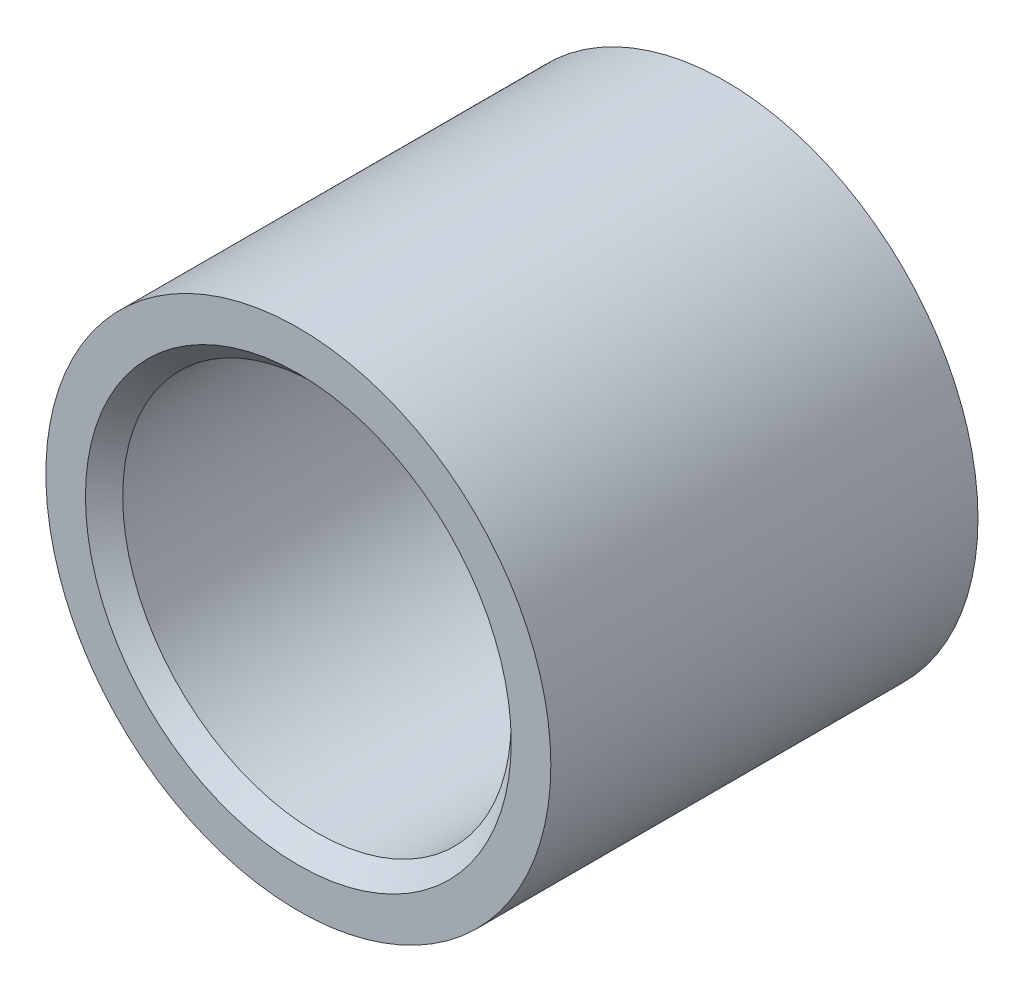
ISO-10303-21;
HEADER;
FILE_DESCRIPTION(('STEP AP214'),'2;1');
FILE_NAME('part.step','',(''),(''),'','','');
FILE_SCHEMA(('AUTOMOTIVE_DESIGN { 1 0 10303 214 1 1 1 1 }'));
ENDSEC;
DATA;
#1=APPLICATION_CONTEXT('core data for automotive mechanical design processes');
#2=APPLICATION_PROTOCOL_DEFINITION('international standard','automotive_design',2000,#1);
#3=PRODUCT_CONTEXT('',#1,'mechanical');
#4=PRODUCT('Part','Part','',(#3));
#5=PRODUCT_RELATED_PRODUCT_CATEGORY('part','',(#4));
#6=PRODUCT_DEFINITION_FORMATION('','',#4);
#7=PRODUCT_DEFINITION_CONTEXT('part definition',#1,'design');
#8=PRODUCT_DEFINITION('design','',#6,#7);
#9=PRODUCT_DEFINITION_SHAPE('','',#8);
#10=(LENGTH_UNIT() NAMED_UNIT(*) SI_UNIT(.MILLI.,.METRE.));
#11=(NAMED_UNIT(*) PLANE_ANGLE_UNIT() SI_UNIT($,.RADIAN.));
#12=(NAMED_UNIT(*) SI_UNIT($,.STERADIAN.) SOLID_ANGLE_UNIT());
#13=UNCERTAINTY_MEASURE_WITH_UNIT(LENGTH_MEASURE(1.E-05),#10,'distance_accuracy_value','');
#14=(GEOMETRIC_REPRESENTATION_CONTEXT(3) GLOBAL_UNCERTAINTY_ASSIGNED_CONTEXT((#13)) GLOBAL_UNIT_ASSIGNED_CONTEXT((#10,
#11,#12)) REPRESENTATION_CONTEXT('',''));
#15=CARTESIAN_POINT('',(0.,0.,0.));
#16=DIRECTION('',(0.,0.,1.));
#17=DIRECTION('',(1.,0.,0.));
#18=AXIS2_PLACEMENT_3D('',#15,#16,#17);
#19=CARTESIAN_POINT('',(0.,0.,31.775));
#20=DIRECTION('',(0.,0.,1.));
#21=DIRECTION('',(1.,0.,0.));
#22=AXIS2_PLACEMENT_3D('',#19,#20,#21);
#23=CYLINDRICAL_SURFACE('',#22,20.64385);
#24=CARTESIAN_POINT('',(0.,0.,0.));
#25=DIRECTION('',(0.,0.,1.));
#26=DIRECTION('',(1.,0.,0.));
#27=AXIS2_PLACEMENT_3D('',#24,#25,#26);
#28=CIRCLE('',#27,20.64385);
#29=CARTESIAN_POINT('',(20.64385,0.,0.));
#30=VERTEX_POINT('',#29);
#31=EDGE_CURVE('E32',#30,#30,#28,.T.);
#32=ORIENTED_EDGE('',*,*,#31,.F.);
#33=EDGE_LOOP('',(#32));
#34=FACE_BOUND('',#33,.T.);
#35=CARTESIAN_POINT('',(0.,0.,-34.925));
#36=DIRECTION('',(0.,0.,1.));
#37=DIRECTION('',(1.,0.,0.));
#38=AXIS2_PLACEMENT_3D('',#35,#36,#37);
#39=CIRCLE('',#38,20.64385);
#40=CARTESIAN_POINT('',(20.64385,0.,-34.925));
#41=VERTEX_POINT('',#40);
#42=EDGE_CURVE('E35',#41,#41,#39,.T.);
#43=ORIENTED_EDGE('',*,*,#42,.T.);
#44=EDGE_LOOP('',(#43));
#45=FACE_BOUND('',#44,.T.);
#46=ADVANCED_FACE('F13',(#34,#45),#23,.T.);
#47=CARTESIAN_POINT('',(20.64385,0.,0.));
#48=DIRECTION('',(0.,0.,-1.));
#49=DIRECTION('',(-1.,0.,0.));
#50=AXIS2_PLACEMENT_3D('',#47,#48,#49);
#51=PLANE('',#50);
#52=CARTESIAN_POINT('',(0.,0.,0.));
#53=DIRECTION('',(0.,0.,-1.));
#54=DIRECTION('',(-1.,0.,0.));
#55=AXIS2_PLACEMENT_3D('',#52,#53,#54);
#56=CIRCLE('',#55,17.40535);
#57=CARTESIAN_POINT('',(-17.40535,0.,0.));
#58=VERTEX_POINT('',#57);
#59=EDGE_CURVE('E9',#58,#58,#56,.T.);
#60=ORIENTED_EDGE('',*,*,#59,.T.);
#61=EDGE_LOOP('',(#60));
#62=FACE_BOUND('',#61,.T.);
#63=ORIENTED_EDGE('',*,*,#31,.T.);
#64=EDGE_LOOP('',(#63));
#65=FACE_BOUND('',#64,.T.);
#66=ADVANCED_FACE('F55',(#62,#65),#51,.F.);
#67=CARTESIAN_POINT('',(0.,0.,31.775));
#68=DIRECTION('',(0.,0.,1.));
#69=DIRECTION('',(1.,0.,0.));
#70=AXIS2_PLACEMENT_3D('',#67,#68,#69);
#71=CYLINDRICAL_SURFACE('',#70,15.88135);
#72=CARTESIAN_POINT('',(0.,0.,-33.401));
#73=DIRECTION('',(0.,0.,1.));
#74=DIRECTION('',(1.,0.,0.));
#75=AXIS2_PLACEMENT_3D('',#72,#73,#74);
#76=CIRCLE('',#75,15.88135);
#77=CARTESIAN_POINT('',(15.88135,0.,-33.401));
#78=VERTEX_POINT('',#77);
#79=EDGE_CURVE('E19',#78,#78,#76,.F.);
#80=ORIENTED_EDGE('',*,*,#79,.T.);
#81=EDGE_LOOP('',(#80));
#82=FACE_BOUND('',#81,.T.);
#83=CARTESIAN_POINT('',(0.,0.,-1.524));
#84=DIRECTION('',(0.,0.,-1.));
#85=DIRECTION('',(-1.,0.,0.));
#86=AXIS2_PLACEMENT_3D('',#83,#84,#85);
#87=CIRCLE('',#86,15.88135);
#88=CARTESIAN_POINT('',(-15.88135,0.,-1.524));
#89=VERTEX_POINT('',#88);
#90=EDGE_CURVE('E23',#89,#89,#87,.F.);
#91=ORIENTED_EDGE('',*,*,#90,.T.);
#92=EDGE_LOOP('',(#91));
#93=FACE_BOUND('',#92,.T.);
#94=ADVANCED_FACE('F43',(#82,#93),#71,.F.);
#95=CARTESIAN_POINT('',(15.88135,0.,-34.925));
#96=DIRECTION('',(0.,0.,1.));
#97=DIRECTION('',(1.,0.,0.));
#98=AXIS2_PLACEMENT_3D('',#95,#96,#97);
#99=PLANE('',#98);
#100=CARTESIAN_POINT('',(0.,0.,-34.925));
#101=DIRECTION('',(0.,0.,1.));
#102=DIRECTION('',(1.,0.,0.));
#103=AXIS2_PLACEMENT_3D('',#100,#101,#102);
#104=CIRCLE('',#103,17.40535);
#105=CARTESIAN_POINT('',(17.40535,0.,-34.925));
#106=VERTEX_POINT('',#105);
#107=EDGE_CURVE('E27',#106,#106,#104,.T.);
#108=ORIENTED_EDGE('',*,*,#107,.T.);
#109=EDGE_LOOP('',(#108));
#110=FACE_BOUND('',#109,.T.);
#111=ORIENTED_EDGE('',*,*,#42,.F.);
#112=EDGE_LOOP('',(#111));
#113=FACE_BOUND('',#112,.T.);
#114=ADVANCED_FACE('F40',(#110,#113),#99,.F.);
#115=CARTESIAN_POINT('',(0.,0.,-34.925));
#116=DIRECTION('',(0.,0.,-1.));
#117=DIRECTION('',(-1.,0.,0.));
#118=AXIS2_PLACEMENT_3D('',#115,#116,#117);
#119=CONICAL_SURFACE('',#118,17.40535,0.785398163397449);
#120=ORIENTED_EDGE('',*,*,#79,.F.);
#121=EDGE_LOOP('',(#120));
#122=FACE_BOUND('',#121,.T.);
#123=ORIENTED_EDGE('',*,*,#107,.F.);
#124=EDGE_LOOP('',(#123));
#125=FACE_BOUND('',#124,.T.);
#126=ADVANCED_FACE('F42',(#122,#125),#119,.F.);
#127=CARTESIAN_POINT('',(0.,0.,-1.524));
#128=DIRECTION('',(0.,0.,1.));
#129=DIRECTION('',(1.,0.,0.));
#130=AXIS2_PLACEMENT_3D('',#127,#128,#129);
#131=CONICAL_SURFACE('',#130,15.88135,0.785398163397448);
#132=ORIENTED_EDGE('',*,*,#59,.F.);
#133=EDGE_LOOP('',(#132));
#134=FACE_BOUND('',#133,.T.);
#135=ORIENTED_EDGE('',*,*,#90,.F.);
#136=EDGE_LOOP('',(#135));
#137=FACE_BOUND('',#136,.T.);
#138=ADVANCED_FACE('F52',(#134,#137),#131,.F.);
#139=CLOSED_SHELL('',(#46,#66,#94,#114,#126,#138));
#140=MANIFOLD_SOLID_BREP('B1',#139);
#141=ADVANCED_BREP_SHAPE_REPRESENTATION('',(#18,#140),#14);
#142=SHAPE_DEFINITION_REPRESENTATION(#9,#141);
ENDSEC;
END-ISO-10303-21;
